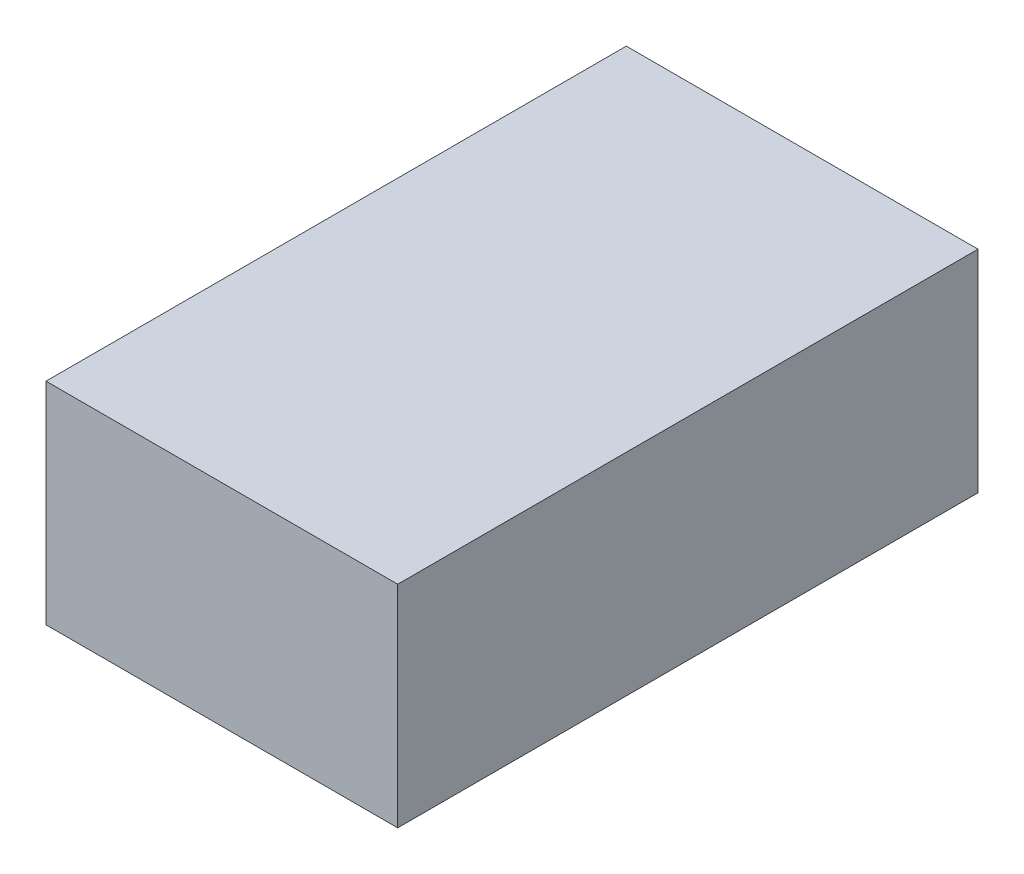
ISO-10303-21;
HEADER;
FILE_DESCRIPTION(('STEP AP214'),'2;1');
FILE_NAME('part.step','',(''),(''),'','','');
FILE_SCHEMA(('AUTOMOTIVE_DESIGN { 1 0 10303 214 1 1 1 1 }'));
ENDSEC;
DATA;
#1=APPLICATION_CONTEXT('core data for automotive mechanical design processes');
#2=APPLICATION_PROTOCOL_DEFINITION('international standard','automotive_design',2000,#1);
#3=PRODUCT_CONTEXT('',#1,'mechanical');
#4=PRODUCT('Part','Part','',(#3));
#5=PRODUCT_RELATED_PRODUCT_CATEGORY('part','',(#4));
#6=PRODUCT_DEFINITION_FORMATION('','',#4);
#7=PRODUCT_DEFINITION_CONTEXT('part definition',#1,'design');
#8=PRODUCT_DEFINITION('design','',#6,#7);
#9=PRODUCT_DEFINITION_SHAPE('','',#8);
#10=(LENGTH_UNIT() NAMED_UNIT(*) SI_UNIT(.MILLI.,.METRE.));
#11=(NAMED_UNIT(*) PLANE_ANGLE_UNIT() SI_UNIT($,.RADIAN.));
#12=(NAMED_UNIT(*) SI_UNIT($,.STERADIAN.) SOLID_ANGLE_UNIT());
#13=UNCERTAINTY_MEASURE_WITH_UNIT(LENGTH_MEASURE(1.E-05),#10,'distance_accuracy_value','');
#14=(GEOMETRIC_REPRESENTATION_CONTEXT(3) GLOBAL_UNCERTAINTY_ASSIGNED_CONTEXT((#13)) GLOBAL_UNIT_ASSIGNED_CONTEXT((#10,
#11,#12)) REPRESENTATION_CONTEXT('',''));
#15=CARTESIAN_POINT('',(0.,0.,0.));
#16=DIRECTION('',(0.,0.,1.));
#17=DIRECTION('',(1.,0.,0.));
#18=AXIS2_PLACEMENT_3D('',#15,#16,#17);
#19=CARTESIAN_POINT('',(63.5,-19.05,104.775));
#20=DIRECTION('',(0.,1.,0.));
#21=DIRECTION('',(0.,0.,1.));
#22=AXIS2_PLACEMENT_3D('',#19,#20,#21);
#23=PLANE('',#22);
#24=DIRECTION('',(0.,0.,-1.));
#25=VECTOR('',#24,1.);
#26=CARTESIAN_POINT('',(0.,-19.05,104.775));
#27=LINE('',#26,#25);
#28=CARTESIAN_POINT('',(0.,-19.05,104.775));
#29=VERTEX_POINT('',#28);
#30=CARTESIAN_POINT('',(0.,-19.05,0.));
#31=VERTEX_POINT('',#30);
#32=EDGE_CURVE('E115',#29,#31,#27,.T.);
#33=ORIENTED_EDGE('',*,*,#32,.T.);
#34=DIRECTION('',(-1.,0.,0.));
#35=VECTOR('',#34,1.);
#36=CARTESIAN_POINT('',(63.5,-19.05,0.));
#37=LINE('',#36,#35);
#38=CARTESIAN_POINT('',(63.5,-19.05,0.));
#39=VERTEX_POINT('',#38);
#40=EDGE_CURVE('E11',#39,#31,#37,.T.);
#41=ORIENTED_EDGE('',*,*,#40,.F.);
#42=DIRECTION('',(0.,0.,-1.));
#43=VECTOR('',#42,1.);
#44=CARTESIAN_POINT('',(63.5,-19.05,104.775));
#45=LINE('',#44,#43);
#46=CARTESIAN_POINT('',(63.5,-19.05,104.775));
#47=VERTEX_POINT('',#46);
#48=EDGE_CURVE('E92',#47,#39,#45,.T.);
#49=ORIENTED_EDGE('',*,*,#48,.F.);
#50=DIRECTION('',(-1.,0.,0.));
#51=VECTOR('',#50,1.);
#52=CARTESIAN_POINT('',(63.5,-19.05,104.775));
#53=LINE('',#52,#51);
#54=EDGE_CURVE('E107',#47,#29,#53,.T.);
#55=ORIENTED_EDGE('',*,*,#54,.T.);
#56=EDGE_LOOP('',(#33,#41,#49,#55));
#57=FACE_BOUND('',#56,.T.);
#58=ADVANCED_FACE('F43',(#57),#23,.F.);
#59=CARTESIAN_POINT('',(63.5,-19.05,0.));
#60=DIRECTION('',(0.,0.,1.));
#61=DIRECTION('',(1.,0.,0.));
#62=AXIS2_PLACEMENT_3D('',#59,#60,#61);
#63=PLANE('',#62);
#64=DIRECTION('',(0.,1.,0.));
#65=VECTOR('',#64,1.);
#66=CARTESIAN_POINT('',(0.,-19.05,0.));
#67=LINE('',#66,#65);
#68=CARTESIAN_POINT('',(0.,19.05,0.));
#69=VERTEX_POINT('',#68);
#70=EDGE_CURVE('E99',#31,#69,#67,.T.);
#71=ORIENTED_EDGE('',*,*,#70,.T.);
#72=DIRECTION('',(-1.,0.,0.));
#73=VECTOR('',#72,1.);
#74=CARTESIAN_POINT('',(63.5,19.05,0.));
#75=LINE('',#74,#73);
#76=CARTESIAN_POINT('',(63.5,19.05,0.));
#77=VERTEX_POINT('',#76);
#78=EDGE_CURVE('E55',#77,#69,#75,.T.);
#79=ORIENTED_EDGE('',*,*,#78,.F.);
#80=DIRECTION('',(0.,1.,0.));
#81=VECTOR('',#80,1.);
#82=CARTESIAN_POINT('',(63.5,-19.05,0.));
#83=LINE('',#82,#81);
#84=EDGE_CURVE('E89',#39,#77,#83,.T.);
#85=ORIENTED_EDGE('',*,*,#84,.F.);
#86=ORIENTED_EDGE('',*,*,#40,.T.);
#87=EDGE_LOOP('',(#71,#79,#85,#86));
#88=FACE_BOUND('',#87,.T.);
#89=ADVANCED_FACE('F97',(#88),#63,.F.);
#90=CARTESIAN_POINT('',(63.5,19.05,0.));
#91=DIRECTION('',(0.,-1.,0.));
#92=DIRECTION('',(0.,0.,-1.));
#93=AXIS2_PLACEMENT_3D('',#90,#91,#92);
#94=PLANE('',#93);
#95=DIRECTION('',(0.,0.,1.));
#96=VECTOR('',#95,1.);
#97=CARTESIAN_POINT('',(0.,19.05,0.));
#98=LINE('',#97,#96);
#99=CARTESIAN_POINT('',(0.,19.05,104.775));
#100=VERTEX_POINT('',#99);
#101=EDGE_CURVE('E80',#69,#100,#98,.T.);
#102=ORIENTED_EDGE('',*,*,#101,.T.);
#103=DIRECTION('',(-1.,0.,0.));
#104=VECTOR('',#103,1.);
#105=CARTESIAN_POINT('',(63.5,19.05,104.775));
#106=LINE('',#105,#104);
#107=CARTESIAN_POINT('',(63.5,19.05,104.775));
#108=VERTEX_POINT('',#107);
#109=EDGE_CURVE('E105',#108,#100,#106,.T.);
#110=ORIENTED_EDGE('',*,*,#109,.F.);
#111=DIRECTION('',(0.,0.,1.));
#112=VECTOR('',#111,1.);
#113=CARTESIAN_POINT('',(63.5,19.05,0.));
#114=LINE('',#113,#112);
#115=EDGE_CURVE('E91',#77,#108,#114,.T.);
#116=ORIENTED_EDGE('',*,*,#115,.F.);
#117=ORIENTED_EDGE('',*,*,#78,.T.);
#118=EDGE_LOOP('',(#102,#110,#116,#117));
#119=FACE_BOUND('',#118,.T.);
#120=ADVANCED_FACE('F103',(#119),#94,.F.);
#121=CARTESIAN_POINT('',(63.5,19.05,104.775));
#122=DIRECTION('',(0.,0.,-1.));
#123=DIRECTION('',(-1.,0.,0.));
#124=AXIS2_PLACEMENT_3D('',#121,#122,#123);
#125=PLANE('',#124);
#126=DIRECTION('',(0.,-1.,0.));
#127=VECTOR('',#126,1.);
#128=CARTESIAN_POINT('',(0.,19.05,104.775));
#129=LINE('',#128,#127);
#130=EDGE_CURVE('E83',#100,#29,#129,.T.);
#131=ORIENTED_EDGE('',*,*,#130,.T.);
#132=ORIENTED_EDGE('',*,*,#54,.F.);
#133=DIRECTION('',(0.,-1.,0.));
#134=VECTOR('',#133,1.);
#135=CARTESIAN_POINT('',(63.5,19.05,104.775));
#136=LINE('',#135,#134);
#137=EDGE_CURVE('E58',#108,#47,#136,.T.);
#138=ORIENTED_EDGE('',*,*,#137,.F.);
#139=ORIENTED_EDGE('',*,*,#109,.T.);
#140=EDGE_LOOP('',(#131,#132,#138,#139));
#141=FACE_BOUND('',#140,.T.);
#142=ADVANCED_FACE('F127',(#141),#125,.F.);
#143=CARTESIAN_POINT('',(63.5,0.,0.));
#144=DIRECTION('',(1.,0.,0.));
#145=DIRECTION('',(0.,0.,-1.));
#146=AXIS2_PLACEMENT_3D('',#143,#144,#145);
#147=PLANE('',#146);
#148=ORIENTED_EDGE('',*,*,#48,.T.);
#149=ORIENTED_EDGE('',*,*,#84,.T.);
#150=ORIENTED_EDGE('',*,*,#115,.T.);
#151=ORIENTED_EDGE('',*,*,#137,.T.);
#152=EDGE_LOOP('',(#148,#149,#150,#151));
#153=FACE_BOUND('',#152,.T.);
#154=ADVANCED_FACE('F93',(#153),#147,.T.);
#155=CARTESIAN_POINT('',(0.,0.,0.));
#156=DIRECTION('',(1.,0.,0.));
#157=DIRECTION('',(0.,0.,-1.));
#158=AXIS2_PLACEMENT_3D('',#155,#156,#157);
#159=PLANE('',#158);
#160=ORIENTED_EDGE('',*,*,#32,.F.);
#161=ORIENTED_EDGE('',*,*,#130,.F.);
#162=ORIENTED_EDGE('',*,*,#101,.F.);
#163=ORIENTED_EDGE('',*,*,#70,.F.);
#164=EDGE_LOOP('',(#160,#161,#162,#163));
#165=FACE_BOUND('',#164,.T.);
#166=ADVANCED_FACE('F129',(#165),#159,.F.);
#167=CLOSED_SHELL('',(#58,#89,#120,#142,#154,#166));
#168=MANIFOLD_SOLID_BREP('B2',#167);
#169=ADVANCED_BREP_SHAPE_REPRESENTATION('',(#18,#168),#14);
#170=SHAPE_DEFINITION_REPRESENTATION(#9,#169);
ENDSEC;
END-ISO-10303-21;
